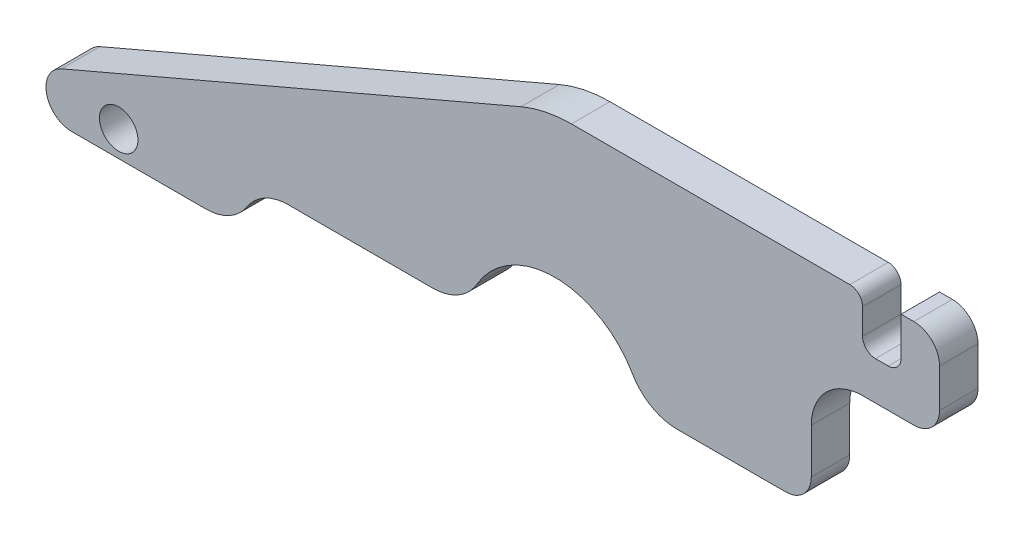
ISO-10303-21;
HEADER;
FILE_DESCRIPTION(('STEP AP214'),'2;1');
FILE_NAME('part.step','',(''),(''),'','','');
FILE_SCHEMA(('AUTOMOTIVE_DESIGN { 1 0 10303 214 1 1 1 1 }'));
ENDSEC;
DATA;
#1=APPLICATION_CONTEXT('core data for automotive mechanical design processes');
#2=APPLICATION_PROTOCOL_DEFINITION('international standard','automotive_design',2000,#1);
#3=PRODUCT_CONTEXT('',#1,'mechanical');
#4=PRODUCT('Part','Part','',(#3));
#5=PRODUCT_RELATED_PRODUCT_CATEGORY('part','',(#4));
#6=PRODUCT_DEFINITION_FORMATION('','',#4);
#7=PRODUCT_DEFINITION_CONTEXT('part definition',#1,'design');
#8=PRODUCT_DEFINITION('design','',#6,#7);
#9=PRODUCT_DEFINITION_SHAPE('','',#8);
#10=(LENGTH_UNIT() NAMED_UNIT(*) SI_UNIT(.MILLI.,.METRE.));
#11=(NAMED_UNIT(*) PLANE_ANGLE_UNIT() SI_UNIT($,.RADIAN.));
#12=(NAMED_UNIT(*) SI_UNIT($,.STERADIAN.) SOLID_ANGLE_UNIT());
#13=UNCERTAINTY_MEASURE_WITH_UNIT(LENGTH_MEASURE(1.E-05),#10,'distance_accuracy_value','');
#14=(GEOMETRIC_REPRESENTATION_CONTEXT(3) GLOBAL_UNCERTAINTY_ASSIGNED_CONTEXT((#13)) GLOBAL_UNIT_ASSIGNED_CONTEXT((#10,
#11,#12)) REPRESENTATION_CONTEXT('',''));
#15=CARTESIAN_POINT('',(0.,0.,0.));
#16=DIRECTION('',(0.,0.,1.));
#17=DIRECTION('',(1.,0.,0.));
#18=AXIS2_PLACEMENT_3D('',#15,#16,#17);
#19=CARTESIAN_POINT('',(5.99999999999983,12.5625,1.5));
#20=DIRECTION('',(0.,0.,-1.));
#21=DIRECTION('',(-1.,0.,0.));
#22=AXIS2_PLACEMENT_3D('',#19,#20,#21);
#23=PLANE('',#22);
#24=DIRECTION('',(-1.,0.,0.));
#25=VECTOR('',#24,1.);
#26=CARTESIAN_POINT('',(5.49999999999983,13.5625,1.5));
#27=LINE('',#26,#25);
#28=CARTESIAN_POINT('',(5.99999999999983,13.5625,1.5));
#29=VERTEX_POINT('',#28);
#30=CARTESIAN_POINT('',(5.49999999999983,13.5625,1.5));
#31=VERTEX_POINT('',#30);
#32=EDGE_CURVE('E290',#29,#31,#27,.T.);
#33=ORIENTED_EDGE('',*,*,#32,.T.);
#34=DIRECTION('',(0.,-1.,0.));
#35=VECTOR('',#34,1.);
#36=CARTESIAN_POINT('',(5.49999999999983,12.0625,1.5));
#37=LINE('',#36,#35);
#38=CARTESIAN_POINT('',(5.49999999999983,12.0625,1.5));
#39=VERTEX_POINT('',#38);
#40=EDGE_CURVE('E147',#31,#39,#37,.T.);
#41=ORIENTED_EDGE('',*,*,#40,.T.);
#42=CARTESIAN_POINT('',(4.99999999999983,12.0625,1.5));
#43=DIRECTION('',(0.,0.,-1.));
#44=DIRECTION('',(1.,0.,0.));
#45=AXIS2_PLACEMENT_3D('',#42,#43,#44);
#46=CIRCLE('',#45,0.5);
#47=CARTESIAN_POINT('',(4.99999999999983,11.5625,1.5));
#48=VERTEX_POINT('',#47);
#49=EDGE_CURVE('E359',#39,#48,#46,.T.);
#50=ORIENTED_EDGE('',*,*,#49,.T.);
#51=DIRECTION('',(-1.,0.,0.));
#52=VECTOR('',#51,1.);
#53=CARTESIAN_POINT('',(4.49999999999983,11.5625,1.5));
#54=LINE('',#53,#52);
#55=CARTESIAN_POINT('',(4.49999999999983,11.5625,1.5));
#56=VERTEX_POINT('',#55);
#57=EDGE_CURVE('E378',#48,#56,#54,.T.);
#58=ORIENTED_EDGE('',*,*,#57,.T.);
#59=CARTESIAN_POINT('',(4.49999999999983,12.0625,1.5));
#60=DIRECTION('',(0.,0.,-1.));
#61=DIRECTION('',(1.,0.,0.));
#62=AXIS2_PLACEMENT_3D('',#59,#60,#61);
#63=CIRCLE('',#62,0.500000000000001);
#64=CARTESIAN_POINT('',(3.99999999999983,12.0625,1.5));
#65=VERTEX_POINT('',#64);
#66=EDGE_CURVE('E375',#56,#65,#63,.T.);
#67=ORIENTED_EDGE('',*,*,#66,.T.);
#68=DIRECTION('',(0.,1.,0.));
#69=VECTOR('',#68,1.);
#70=CARTESIAN_POINT('',(3.99999999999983,13.0625,1.5));
#71=LINE('',#70,#69);
#72=CARTESIAN_POINT('',(3.99999999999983,13.0625,1.5));
#73=VERTEX_POINT('',#72);
#74=EDGE_CURVE('E377',#65,#73,#71,.T.);
#75=ORIENTED_EDGE('',*,*,#74,.T.);
#76=CARTESIAN_POINT('',(3.49999999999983,13.0625,1.5));
#77=DIRECTION('',(0.,0.,1.));
#78=DIRECTION('',(-1.,0.,0.));
#79=AXIS2_PLACEMENT_3D('',#76,#77,#78);
#80=CIRCLE('',#79,0.5);
#81=CARTESIAN_POINT('',(3.49999999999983,13.5625,1.5));
#82=VERTEX_POINT('',#81);
#83=EDGE_CURVE('E380',#73,#82,#80,.T.);
#84=ORIENTED_EDGE('',*,*,#83,.T.);
#85=DIRECTION('',(-1.,0.,0.));
#86=VECTOR('',#85,1.);
#87=CARTESIAN_POINT('',(-7.3486426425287,13.5625,1.5));
#88=LINE('',#87,#86);
#89=CARTESIAN_POINT('',(-7.3486426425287,13.5625,1.5));
#90=VERTEX_POINT('',#89);
#91=EDGE_CURVE('E386',#82,#90,#88,.T.);
#92=ORIENTED_EDGE('',*,*,#91,.T.);
#93=CARTESIAN_POINT('',(-7.3486426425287,8.56250000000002,1.5));
#94=DIRECTION('',(0.,0.,1.));
#95=DIRECTION('',(-1.,0.,0.));
#96=AXIS2_PLACEMENT_3D('',#93,#94,#95);
#97=CIRCLE('',#96,5.);
#98=CARTESIAN_POINT('',(-9.31836057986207,13.1581731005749,1.5));
#99=VERTEX_POINT('',#98);
#100=EDGE_CURVE('E388',#90,#99,#97,.T.);
#101=ORIENTED_EDGE('',*,*,#100,.T.);
#102=DIRECTION('',(-0.919134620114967,-0.393943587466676,0.));
#103=VECTOR('',#102,1.);
#104=CARTESIAN_POINT('',(-27.2289764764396,5.48163462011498,1.5));
#105=LINE('',#104,#103);
#106=CARTESIAN_POINT('',(-27.2289764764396,5.48163462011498,1.5));
#107=VERTEX_POINT('',#106);
#108=EDGE_CURVE('E390',#99,#107,#105,.T.);
#109=ORIENTED_EDGE('',*,*,#108,.T.);
#110=CARTESIAN_POINT('',(-26.8350328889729,4.56250000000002,1.5));
#111=DIRECTION('',(0.,0.,1.));
#112=DIRECTION('',(1.,0.,0.));
#113=AXIS2_PLACEMENT_3D('',#110,#111,#112);
#114=CIRCLE('',#113,0.999999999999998);
#115=CARTESIAN_POINT('',(-26.8350328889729,3.56250000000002,1.5));
#116=VERTEX_POINT('',#115);
#117=EDGE_CURVE('E392',#107,#116,#114,.T.);
#118=ORIENTED_EDGE('',*,*,#117,.T.);
#119=DIRECTION('',(1.,0.,0.));
#120=VECTOR('',#119,1.);
#121=CARTESIAN_POINT('',(-26.8350328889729,3.56250000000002,1.5));
#122=LINE('',#121,#120);
#123=CARTESIAN_POINT('',(-21.6038867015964,3.56250000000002,1.5));
#124=VERTEX_POINT('',#123);
#125=EDGE_CURVE('E394',#116,#124,#122,.T.);
#126=ORIENTED_EDGE('',*,*,#125,.T.);
#127=CARTESIAN_POINT('',(-21.6038867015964,5.46997288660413,1.5));
#128=DIRECTION('',(0.,0.,1.));
#129=DIRECTION('',(1.,0.,0.));
#130=AXIS2_PLACEMENT_3D('',#127,#128,#129);
#131=CIRCLE('',#130,1.90747288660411);
#132=CARTESIAN_POINT('',(-20.0000000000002,4.43750000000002,1.5));
#133=VERTEX_POINT('',#132);
#134=EDGE_CURVE('E396',#124,#133,#131,.T.);
#135=ORIENTED_EDGE('',*,*,#134,.T.);
#136=CARTESIAN_POINT('',(-18.396113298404,3.40502711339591,1.5));
#137=DIRECTION('',(0.,0.,-1.));
#138=DIRECTION('',(-1.,0.,0.));
#139=AXIS2_PLACEMENT_3D('',#136,#137,#138);
#140=CIRCLE('',#139,1.90747288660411);
#141=CARTESIAN_POINT('',(-18.396113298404,5.31250000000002,1.5));
#142=VERTEX_POINT('',#141);
#143=EDGE_CURVE('E398',#133,#142,#140,.T.);
#144=ORIENTED_EDGE('',*,*,#143,.T.);
#145=DIRECTION('',(1.,0.,0.));
#146=VECTOR('',#145,1.);
#147=CARTESIAN_POINT('',(-12.7631397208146,5.31250000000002,1.5));
#148=LINE('',#147,#146);
#149=CARTESIAN_POINT('',(-12.7631397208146,5.31250000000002,1.5));
#150=VERTEX_POINT('',#149);
#151=EDGE_CURVE('E400',#142,#150,#148,.T.);
#152=ORIENTED_EDGE('',*,*,#151,.T.);
#153=CARTESIAN_POINT('',(-12.7631397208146,7.31250000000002,1.5));
#154=DIRECTION('',(0.,0.,1.));
#155=DIRECTION('',(-1.,0.,0.));
#156=AXIS2_PLACEMENT_3D('',#153,#154,#155);
#157=CIRCLE('',#156,2.);
#158=CARTESIAN_POINT('',(-11.0310889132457,6.31250000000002,1.5));
#159=VERTEX_POINT('',#158);
#160=EDGE_CURVE('E402',#150,#159,#157,.T.);
#161=ORIENTED_EDGE('',*,*,#160,.T.);
#162=CARTESIAN_POINT('',(-8.00000000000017,4.56250000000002,1.5));
#163=DIRECTION('',(0.,0.,-1.));
#164=DIRECTION('',(-1.,0.,0.));
#165=AXIS2_PLACEMENT_3D('',#162,#163,#164);
#166=CIRCLE('',#165,3.5);
#167=CARTESIAN_POINT('',(-4.96891108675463,6.31250000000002,1.5));
#168=VERTEX_POINT('',#167);
#169=EDGE_CURVE('E404',#159,#168,#166,.T.);
#170=ORIENTED_EDGE('',*,*,#169,.T.);
#171=CARTESIAN_POINT('',(-3.23686027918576,7.31250000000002,1.5));
#172=DIRECTION('',(0.,0.,1.));
#173=DIRECTION('',(1.,0.,0.));
#174=AXIS2_PLACEMENT_3D('',#171,#172,#173);
#175=CIRCLE('',#174,2.);
#176=CARTESIAN_POINT('',(-3.23686027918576,5.31250000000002,1.5));
#177=VERTEX_POINT('',#176);
#178=EDGE_CURVE('E406',#168,#177,#175,.T.);
#179=ORIENTED_EDGE('',*,*,#178,.T.);
#180=DIRECTION('',(1.,0.,0.));
#181=VECTOR('',#180,1.);
#182=CARTESIAN_POINT('',(-3.23686027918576,5.31250000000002,1.5));
#183=LINE('',#182,#181);
#184=CARTESIAN_POINT('',(0.999999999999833,5.31250000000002,1.5));
#185=VERTEX_POINT('',#184);
#186=EDGE_CURVE('E408',#177,#185,#183,.T.);
#187=ORIENTED_EDGE('',*,*,#186,.T.);
#188=CARTESIAN_POINT('',(0.999999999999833,6.31250000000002,1.5));
#189=DIRECTION('',(0.,0.,1.));
#190=DIRECTION('',(-1.,0.,0.));
#191=AXIS2_PLACEMENT_3D('',#188,#189,#190);
#192=CIRCLE('',#191,1.);
#193=CARTESIAN_POINT('',(1.99999999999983,6.31250000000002,1.5));
#194=VERTEX_POINT('',#193);
#195=EDGE_CURVE('E410',#185,#194,#192,.T.);
#196=ORIENTED_EDGE('',*,*,#195,.T.);
#197=DIRECTION('',(0.,1.,0.));
#198=VECTOR('',#197,1.);
#199=CARTESIAN_POINT('',(1.99999999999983,8.06250000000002,1.5));
#200=LINE('',#199,#198);
#201=CARTESIAN_POINT('',(1.99999999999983,8.06250000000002,1.5));
#202=VERTEX_POINT('',#201);
#203=EDGE_CURVE('E412',#194,#202,#200,.T.);
#204=ORIENTED_EDGE('',*,*,#203,.T.);
#205=CARTESIAN_POINT('',(3.99999999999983,8.06250000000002,1.5));
#206=DIRECTION('',(0.,0.,-1.));
#207=DIRECTION('',(1.,0.,0.));
#208=AXIS2_PLACEMENT_3D('',#205,#206,#207);
#209=CIRCLE('',#208,2.);
#210=CARTESIAN_POINT('',(3.99999999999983,10.0625,1.5));
#211=VERTEX_POINT('',#210);
#212=EDGE_CURVE('E414',#202,#211,#209,.T.);
#213=ORIENTED_EDGE('',*,*,#212,.T.);
#214=DIRECTION('',(1.,0.,0.));
#215=VECTOR('',#214,1.);
#216=CARTESIAN_POINT('',(4.15524963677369,10.0625,1.5));
#217=LINE('',#216,#215);
#218=CARTESIAN_POINT('',(5.99999999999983,10.0625,1.5));
#219=VERTEX_POINT('',#218);
#220=EDGE_CURVE('E220',#211,#219,#217,.T.);
#221=ORIENTED_EDGE('',*,*,#220,.T.);
#222=CARTESIAN_POINT('',(5.99999999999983,11.0625,1.5));
#223=DIRECTION('',(0.,0.,1.));
#224=DIRECTION('',(-1.,0.,0.));
#225=AXIS2_PLACEMENT_3D('',#222,#223,#224);
#226=CIRCLE('',#225,1.);
#227=CARTESIAN_POINT('',(6.99999999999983,11.0625,1.5));
#228=VERTEX_POINT('',#227);
#229=EDGE_CURVE('E214',#219,#228,#226,.T.);
#230=ORIENTED_EDGE('',*,*,#229,.T.);
#231=DIRECTION('',(0.,1.,0.));
#232=VECTOR('',#231,1.);
#233=CARTESIAN_POINT('',(6.99999999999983,12.5625,1.5));
#234=LINE('',#233,#232);
#235=CARTESIAN_POINT('',(6.99999999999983,12.5625,1.5));
#236=VERTEX_POINT('',#235);
#237=EDGE_CURVE('E218',#228,#236,#234,.T.);
#238=ORIENTED_EDGE('',*,*,#237,.T.);
#239=CARTESIAN_POINT('',(5.99999999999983,12.5625,1.5));
#240=DIRECTION('',(0.,0.,1.));
#241=DIRECTION('',(-1.,0.,0.));
#242=AXIS2_PLACEMENT_3D('',#239,#240,#241);
#243=CIRCLE('',#242,1.);
#244=EDGE_CURVE('E50',#236,#29,#243,.T.);
#245=ORIENTED_EDGE('',*,*,#244,.T.);
#246=EDGE_LOOP('',(#33,#41,#50,#58,#67,#75,#84,#92,#101,#109,#118,#126,#135,#144,#152,#161,#170,
#179,#187,#196,#204,#213,#221,#230,#238,#245));
#247=FACE_BOUND('',#246,.T.);
#248=CARTESIAN_POINT('',(-25.0000000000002,4.56250000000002,1.5));
#249=DIRECTION('',(0.,0.,1.));
#250=DIRECTION('',(1.,0.,0.));
#251=AXIS2_PLACEMENT_3D('',#248,#249,#250);
#252=CIRCLE('',#251,0.750000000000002);
#253=CARTESIAN_POINT('',(-24.2500000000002,4.56250000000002,1.5));
#254=VERTEX_POINT('',#253);
#255=EDGE_CURVE('E242',#254,#254,#252,.T.);
#256=ORIENTED_EDGE('',*,*,#255,.F.);
#257=EDGE_LOOP('',(#256));
#258=FACE_BOUND('',#257,.T.);
#259=ADVANCED_FACE('F33',(#247,#258),#23,.F.);
#260=CARTESIAN_POINT('',(5.99999999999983,12.5625,0.));
#261=DIRECTION('',(0.,0.,-1.));
#262=DIRECTION('',(-1.,0.,0.));
#263=AXIS2_PLACEMENT_3D('',#260,#261,#262);
#264=PLANE('',#263);
#265=DIRECTION('',(-1.,0.,0.));
#266=VECTOR('',#265,1.);
#267=CARTESIAN_POINT('',(5.49999999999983,13.5625,0.));
#268=LINE('',#267,#266);
#269=CARTESIAN_POINT('',(5.99999999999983,13.5625,0.));
#270=VERTEX_POINT('',#269);
#271=CARTESIAN_POINT('',(5.49999999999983,13.5625,0.));
#272=VERTEX_POINT('',#271);
#273=EDGE_CURVE('E238',#270,#272,#268,.T.);
#274=ORIENTED_EDGE('',*,*,#273,.F.);
#275=CARTESIAN_POINT('',(5.99999999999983,12.5625,0.));
#276=DIRECTION('',(0.,0.,1.));
#277=DIRECTION('',(-1.,0.,0.));
#278=AXIS2_PLACEMENT_3D('',#275,#276,#277);
#279=CIRCLE('',#278,1.);
#280=CARTESIAN_POINT('',(6.99999999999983,12.5625,0.));
#281=VERTEX_POINT('',#280);
#282=EDGE_CURVE('E139',#281,#270,#279,.T.);
#283=ORIENTED_EDGE('',*,*,#282,.F.);
#284=DIRECTION('',(0.,1.,0.));
#285=VECTOR('',#284,1.);
#286=CARTESIAN_POINT('',(6.99999999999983,12.5625,0.));
#287=LINE('',#286,#285);
#288=CARTESIAN_POINT('',(6.99999999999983,11.0625,0.));
#289=VERTEX_POINT('',#288);
#290=EDGE_CURVE('E133',#289,#281,#287,.T.);
#291=ORIENTED_EDGE('',*,*,#290,.F.);
#292=CARTESIAN_POINT('',(5.99999999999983,11.0625,0.));
#293=DIRECTION('',(0.,0.,1.));
#294=DIRECTION('',(-1.,0.,0.));
#295=AXIS2_PLACEMENT_3D('',#292,#293,#294);
#296=CIRCLE('',#295,1.);
#297=CARTESIAN_POINT('',(5.99999999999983,10.0625,0.));
#298=VERTEX_POINT('',#297);
#299=EDGE_CURVE('E228',#298,#289,#296,.T.);
#300=ORIENTED_EDGE('',*,*,#299,.F.);
#301=DIRECTION('',(1.,0.,0.));
#302=VECTOR('',#301,1.);
#303=CARTESIAN_POINT('',(5.99999999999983,10.0625,0.));
#304=LINE('',#303,#302);
#305=CARTESIAN_POINT('',(3.99999999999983,10.0625,0.));
#306=VERTEX_POINT('',#305);
#307=EDGE_CURVE('E285',#306,#298,#304,.T.);
#308=ORIENTED_EDGE('',*,*,#307,.F.);
#309=CARTESIAN_POINT('',(3.99999999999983,8.06250000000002,0.));
#310=DIRECTION('',(0.,0.,-1.));
#311=DIRECTION('',(1.,0.,0.));
#312=AXIS2_PLACEMENT_3D('',#309,#310,#311);
#313=CIRCLE('',#312,2.);
#314=CARTESIAN_POINT('',(1.99999999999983,8.06250000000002,0.));
#315=VERTEX_POINT('',#314);
#316=EDGE_CURVE('E282',#315,#306,#313,.T.);
#317=ORIENTED_EDGE('',*,*,#316,.F.);
#318=DIRECTION('',(0.,1.,0.));
#319=VECTOR('',#318,1.);
#320=CARTESIAN_POINT('',(1.99999999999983,8.06250000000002,0.));
#321=LINE('',#320,#319);
#322=CARTESIAN_POINT('',(1.99999999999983,6.31250000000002,0.));
#323=VERTEX_POINT('',#322);
#324=EDGE_CURVE('E280',#323,#315,#321,.T.);
#325=ORIENTED_EDGE('',*,*,#324,.F.);
#326=CARTESIAN_POINT('',(0.999999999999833,6.31250000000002,0.));
#327=DIRECTION('',(0.,0.,1.));
#328=DIRECTION('',(-1.,0.,0.));
#329=AXIS2_PLACEMENT_3D('',#326,#327,#328);
#330=CIRCLE('',#329,1.);
#331=CARTESIAN_POINT('',(0.999999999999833,5.31250000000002,0.));
#332=VERTEX_POINT('',#331);
#333=EDGE_CURVE('E278',#332,#323,#330,.T.);
#334=ORIENTED_EDGE('',*,*,#333,.F.);
#335=DIRECTION('',(1.,0.,0.));
#336=VECTOR('',#335,1.);
#337=CARTESIAN_POINT('',(-3.23686027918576,5.31250000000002,0.));
#338=LINE('',#337,#336);
#339=CARTESIAN_POINT('',(-3.23686027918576,5.31250000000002,0.));
#340=VERTEX_POINT('',#339);
#341=EDGE_CURVE('E276',#340,#332,#338,.T.);
#342=ORIENTED_EDGE('',*,*,#341,.F.);
#343=CARTESIAN_POINT('',(-3.23686027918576,7.31250000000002,0.));
#344=DIRECTION('',(0.,0.,1.));
#345=DIRECTION('',(1.,0.,0.));
#346=AXIS2_PLACEMENT_3D('',#343,#344,#345);
#347=CIRCLE('',#346,2.);
#348=CARTESIAN_POINT('',(-4.96891108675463,6.31250000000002,0.));
#349=VERTEX_POINT('',#348);
#350=EDGE_CURVE('E274',#349,#340,#347,.T.);
#351=ORIENTED_EDGE('',*,*,#350,.F.);
#352=CARTESIAN_POINT('',(-8.00000000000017,4.56250000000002,0.));
#353=DIRECTION('',(0.,0.,-1.));
#354=DIRECTION('',(-1.,0.,0.));
#355=AXIS2_PLACEMENT_3D('',#352,#353,#354);
#356=CIRCLE('',#355,3.5);
#357=CARTESIAN_POINT('',(-11.0310889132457,6.31250000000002,0.));
#358=VERTEX_POINT('',#357);
#359=EDGE_CURVE('E272',#358,#349,#356,.T.);
#360=ORIENTED_EDGE('',*,*,#359,.F.);
#361=CARTESIAN_POINT('',(-12.7631397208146,7.31250000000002,0.));
#362=DIRECTION('',(0.,0.,1.));
#363=DIRECTION('',(-1.,0.,0.));
#364=AXIS2_PLACEMENT_3D('',#361,#362,#363);
#365=CIRCLE('',#364,2.);
#366=CARTESIAN_POINT('',(-12.7631397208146,5.31250000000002,0.));
#367=VERTEX_POINT('',#366);
#368=EDGE_CURVE('E270',#367,#358,#365,.T.);
#369=ORIENTED_EDGE('',*,*,#368,.F.);
#370=DIRECTION('',(1.,0.,0.));
#371=VECTOR('',#370,1.);
#372=CARTESIAN_POINT('',(-12.7631397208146,5.31250000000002,0.));
#373=LINE('',#372,#371);
#374=CARTESIAN_POINT('',(-18.396113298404,5.31250000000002,0.));
#375=VERTEX_POINT('',#374);
#376=EDGE_CURVE('E268',#375,#367,#373,.T.);
#377=ORIENTED_EDGE('',*,*,#376,.F.);
#378=CARTESIAN_POINT('',(-18.396113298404,3.40502711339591,0.));
#379=DIRECTION('',(0.,0.,-1.));
#380=DIRECTION('',(-1.,0.,0.));
#381=AXIS2_PLACEMENT_3D('',#378,#379,#380);
#382=CIRCLE('',#381,1.90747288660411);
#383=CARTESIAN_POINT('',(-20.0000000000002,4.43750000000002,0.));
#384=VERTEX_POINT('',#383);
#385=EDGE_CURVE('E266',#384,#375,#382,.T.);
#386=ORIENTED_EDGE('',*,*,#385,.F.);
#387=CARTESIAN_POINT('',(-21.6038867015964,5.46997288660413,0.));
#388=DIRECTION('',(0.,0.,1.));
#389=DIRECTION('',(1.,0.,0.));
#390=AXIS2_PLACEMENT_3D('',#387,#388,#389);
#391=CIRCLE('',#390,1.90747288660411);
#392=CARTESIAN_POINT('',(-21.6038867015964,3.56250000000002,0.));
#393=VERTEX_POINT('',#392);
#394=EDGE_CURVE('E264',#393,#384,#391,.T.);
#395=ORIENTED_EDGE('',*,*,#394,.F.);
#396=DIRECTION('',(1.,0.,0.));
#397=VECTOR('',#396,1.);
#398=CARTESIAN_POINT('',(-26.8350328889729,3.56250000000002,0.));
#399=LINE('',#398,#397);
#400=CARTESIAN_POINT('',(-26.8350328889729,3.56250000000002,0.));
#401=VERTEX_POINT('',#400);
#402=EDGE_CURVE('E262',#401,#393,#399,.T.);
#403=ORIENTED_EDGE('',*,*,#402,.F.);
#404=CARTESIAN_POINT('',(-26.8350328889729,4.56250000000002,0.));
#405=DIRECTION('',(0.,0.,1.));
#406=DIRECTION('',(1.,0.,0.));
#407=AXIS2_PLACEMENT_3D('',#404,#405,#406);
#408=CIRCLE('',#407,0.999999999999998);
#409=CARTESIAN_POINT('',(-27.2289764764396,5.48163462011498,0.));
#410=VERTEX_POINT('',#409);
#411=EDGE_CURVE('E260',#410,#401,#408,.T.);
#412=ORIENTED_EDGE('',*,*,#411,.F.);
#413=DIRECTION('',(-0.919134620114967,-0.393943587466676,0.));
#414=VECTOR('',#413,1.);
#415=CARTESIAN_POINT('',(-27.2289764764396,5.48163462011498,0.));
#416=LINE('',#415,#414);
#417=CARTESIAN_POINT('',(-9.31836057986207,13.1581731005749,0.));
#418=VERTEX_POINT('',#417);
#419=EDGE_CURVE('E258',#418,#410,#416,.T.);
#420=ORIENTED_EDGE('',*,*,#419,.F.);
#421=CARTESIAN_POINT('',(-7.3486426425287,8.56250000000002,0.));
#422=DIRECTION('',(0.,0.,1.));
#423=DIRECTION('',(-1.,0.,0.));
#424=AXIS2_PLACEMENT_3D('',#421,#422,#423);
#425=CIRCLE('',#424,5.);
#426=CARTESIAN_POINT('',(-7.3486426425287,13.5625,0.));
#427=VERTEX_POINT('',#426);
#428=EDGE_CURVE('E256',#427,#418,#425,.T.);
#429=ORIENTED_EDGE('',*,*,#428,.F.);
#430=DIRECTION('',(-1.,0.,0.));
#431=VECTOR('',#430,1.);
#432=CARTESIAN_POINT('',(-7.3486426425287,13.5625,0.));
#433=LINE('',#432,#431);
#434=CARTESIAN_POINT('',(3.49999999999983,13.5625,0.));
#435=VERTEX_POINT('',#434);
#436=EDGE_CURVE('E254',#435,#427,#433,.T.);
#437=ORIENTED_EDGE('',*,*,#436,.F.);
#438=CARTESIAN_POINT('',(3.49999999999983,13.0625,0.));
#439=DIRECTION('',(0.,0.,1.));
#440=DIRECTION('',(-1.,0.,0.));
#441=AXIS2_PLACEMENT_3D('',#438,#439,#440);
#442=CIRCLE('',#441,0.5);
#443=CARTESIAN_POINT('',(3.99999999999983,13.0625,0.));
#444=VERTEX_POINT('',#443);
#445=EDGE_CURVE('E252',#444,#435,#442,.T.);
#446=ORIENTED_EDGE('',*,*,#445,.F.);
#447=DIRECTION('',(0.,1.,0.));
#448=VECTOR('',#447,1.);
#449=CARTESIAN_POINT('',(3.99999999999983,13.0625,0.));
#450=LINE('',#449,#448);
#451=CARTESIAN_POINT('',(3.99999999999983,12.0625,0.));
#452=VERTEX_POINT('',#451);
#453=EDGE_CURVE('E250',#452,#444,#450,.T.);
#454=ORIENTED_EDGE('',*,*,#453,.F.);
#455=CARTESIAN_POINT('',(4.49999999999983,12.0625,0.));
#456=DIRECTION('',(0.,0.,-1.));
#457=DIRECTION('',(1.,0.,0.));
#458=AXIS2_PLACEMENT_3D('',#455,#456,#457);
#459=CIRCLE('',#458,0.500000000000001);
#460=CARTESIAN_POINT('',(4.49999999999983,11.5625,0.));
#461=VERTEX_POINT('',#460);
#462=EDGE_CURVE('E248',#461,#452,#459,.T.);
#463=ORIENTED_EDGE('',*,*,#462,.F.);
#464=DIRECTION('',(-1.,0.,0.));
#465=VECTOR('',#464,1.);
#466=CARTESIAN_POINT('',(4.49999999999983,11.5625,0.));
#467=LINE('',#466,#465);
#468=CARTESIAN_POINT('',(4.99999999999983,11.5625,0.));
#469=VERTEX_POINT('',#468);
#470=EDGE_CURVE('E246',#469,#461,#467,.T.);
#471=ORIENTED_EDGE('',*,*,#470,.F.);
#472=CARTESIAN_POINT('',(4.99999999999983,12.0625,0.));
#473=DIRECTION('',(0.,0.,-1.));
#474=DIRECTION('',(1.,0.,0.));
#475=AXIS2_PLACEMENT_3D('',#472,#473,#474);
#476=CIRCLE('',#475,0.5);
#477=CARTESIAN_POINT('',(5.49999999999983,12.0625,0.));
#478=VERTEX_POINT('',#477);
#479=EDGE_CURVE('E244',#478,#469,#476,.T.);
#480=ORIENTED_EDGE('',*,*,#479,.F.);
#481=DIRECTION('',(0.,-1.,0.));
#482=VECTOR('',#481,1.);
#483=CARTESIAN_POINT('',(5.49999999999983,12.0625,0.));
#484=LINE('',#483,#482);
#485=EDGE_CURVE('E241',#272,#478,#484,.T.);
#486=ORIENTED_EDGE('',*,*,#485,.F.);
#487=EDGE_LOOP('',(#274,#283,#291,#300,#308,#317,#325,#334,#342,#351,#360,#369,#377,#386,#395,
#403,#412,#420,#429,#437,#446,#454,#463,#471,#480,#486));
#488=FACE_BOUND('',#487,.T.);
#489=CARTESIAN_POINT('',(-25.0000000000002,4.56250000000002,0.));
#490=DIRECTION('',(0.,0.,1.));
#491=DIRECTION('',(1.,0.,0.));
#492=AXIS2_PLACEMENT_3D('',#489,#490,#491);
#493=CIRCLE('',#492,0.750000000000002);
#494=CARTESIAN_POINT('',(-24.2500000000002,4.56250000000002,0.));
#495=VERTEX_POINT('',#494);
#496=EDGE_CURVE('E745',#495,#495,#493,.T.);
#497=ORIENTED_EDGE('',*,*,#496,.T.);
#498=EDGE_LOOP('',(#497));
#499=FACE_BOUND('',#498,.T.);
#500=ADVANCED_FACE('F363',(#488,#499),#264,.T.);
#501=CARTESIAN_POINT('',(5.49999999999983,13.5625,1.5));
#502=DIRECTION('',(0.,-1.,0.));
#503=DIRECTION('',(0.,0.,-1.));
#504=AXIS2_PLACEMENT_3D('',#501,#502,#503);
#505=PLANE('',#504);
#506=ORIENTED_EDGE('',*,*,#273,.T.);
#507=DIRECTION('',(0.,0.,-1.));
#508=VECTOR('',#507,1.);
#509=CARTESIAN_POINT('',(5.49999999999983,13.5625,1.5));
#510=LINE('',#509,#508);
#511=EDGE_CURVE('E11',#31,#272,#510,.T.);
#512=ORIENTED_EDGE('',*,*,#511,.F.);
#513=ORIENTED_EDGE('',*,*,#32,.F.);
#514=DIRECTION('',(0.,0.,-1.));
#515=VECTOR('',#514,1.);
#516=CARTESIAN_POINT('',(5.99999999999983,13.5625,1.5));
#517=LINE('',#516,#515);
#518=EDGE_CURVE('E234',#29,#270,#517,.T.);
#519=ORIENTED_EDGE('',*,*,#518,.T.);
#520=EDGE_LOOP('',(#506,#512,#513,#519));
#521=FACE_BOUND('',#520,.T.);
#522=ADVANCED_FACE('F35',(#521),#505,.F.);
#523=CARTESIAN_POINT('',(5.49999999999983,12.0625,1.5));
#524=DIRECTION('',(1.,0.,0.));
#525=DIRECTION('',(0.,0.,-1.));
#526=AXIS2_PLACEMENT_3D('',#523,#524,#525);
#527=PLANE('',#526);
#528=ORIENTED_EDGE('',*,*,#485,.T.);
#529=DIRECTION('',(0.,0.,-1.));
#530=VECTOR('',#529,1.);
#531=CARTESIAN_POINT('',(5.49999999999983,12.0625,1.5));
#532=LINE('',#531,#530);
#533=EDGE_CURVE('E42',#39,#478,#532,.T.);
#534=ORIENTED_EDGE('',*,*,#533,.F.);
#535=ORIENTED_EDGE('',*,*,#40,.F.);
#536=ORIENTED_EDGE('',*,*,#511,.T.);
#537=EDGE_LOOP('',(#528,#534,#535,#536));
#538=FACE_BOUND('',#537,.T.);
#539=ADVANCED_FACE('F447',(#538),#527,.F.);
#540=CARTESIAN_POINT('',(4.99999999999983,12.0625,1.5));
#541=DIRECTION('',(0.,0.,-1.));
#542=DIRECTION('',(-1.,0.,0.));
#543=AXIS2_PLACEMENT_3D('',#540,#541,#542);
#544=CYLINDRICAL_SURFACE('',#543,0.5);
#545=ORIENTED_EDGE('',*,*,#479,.T.);
#546=DIRECTION('',(0.,0.,-1.));
#547=VECTOR('',#546,1.);
#548=CARTESIAN_POINT('',(4.99999999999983,11.5625,1.5));
#549=LINE('',#548,#547);
#550=EDGE_CURVE('E351',#48,#469,#549,.T.);
#551=ORIENTED_EDGE('',*,*,#550,.F.);
#552=ORIENTED_EDGE('',*,*,#49,.F.);
#553=ORIENTED_EDGE('',*,*,#533,.T.);
#554=EDGE_LOOP('',(#545,#551,#552,#553));
#555=FACE_BOUND('',#554,.T.);
#556=ADVANCED_FACE('F357',(#555),#544,.F.);
#557=CARTESIAN_POINT('',(4.49999999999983,11.5625,1.5));
#558=DIRECTION('',(0.,-1.,0.));
#559=DIRECTION('',(0.,0.,-1.));
#560=AXIS2_PLACEMENT_3D('',#557,#558,#559);
#561=PLANE('',#560);
#562=ORIENTED_EDGE('',*,*,#470,.T.);
#563=DIRECTION('',(0.,0.,-1.));
#564=VECTOR('',#563,1.);
#565=CARTESIAN_POINT('',(4.49999999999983,11.5625,1.5));
#566=LINE('',#565,#564);
#567=EDGE_CURVE('E348',#56,#461,#566,.T.);
#568=ORIENTED_EDGE('',*,*,#567,.F.);
#569=ORIENTED_EDGE('',*,*,#57,.F.);
#570=ORIENTED_EDGE('',*,*,#550,.T.);
#571=EDGE_LOOP('',(#562,#568,#569,#570));
#572=FACE_BOUND('',#571,.T.);
#573=ADVANCED_FACE('F369',(#572),#561,.F.);
#574=CARTESIAN_POINT('',(4.49999999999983,12.0625,1.5));
#575=DIRECTION('',(0.,0.,-1.));
#576=DIRECTION('',(-1.,0.,0.));
#577=AXIS2_PLACEMENT_3D('',#574,#575,#576);
#578=CYLINDRICAL_SURFACE('',#577,0.500000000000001);
#579=ORIENTED_EDGE('',*,*,#462,.T.);
#580=DIRECTION('',(0.,0.,-1.));
#581=VECTOR('',#580,1.);
#582=CARTESIAN_POINT('',(3.99999999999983,12.0625,1.5));
#583=LINE('',#582,#581);
#584=EDGE_CURVE('E345',#65,#452,#583,.T.);
#585=ORIENTED_EDGE('',*,*,#584,.F.);
#586=ORIENTED_EDGE('',*,*,#66,.F.);
#587=ORIENTED_EDGE('',*,*,#567,.T.);
#588=EDGE_LOOP('',(#579,#585,#586,#587));
#589=FACE_BOUND('',#588,.T.);
#590=ADVANCED_FACE('F373',(#589),#578,.F.);
#591=CARTESIAN_POINT('',(3.99999999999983,13.0625,1.5));
#592=DIRECTION('',(-1.,0.,0.));
#593=DIRECTION('',(0.,-1.,0.));
#594=AXIS2_PLACEMENT_3D('',#591,#592,#593);
#595=PLANE('',#594);
#596=ORIENTED_EDGE('',*,*,#453,.T.);
#597=DIRECTION('',(0.,0.,-1.));
#598=VECTOR('',#597,1.);
#599=CARTESIAN_POINT('',(3.99999999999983,13.0625,1.5));
#600=LINE('',#599,#598);
#601=EDGE_CURVE('E342',#73,#444,#600,.T.);
#602=ORIENTED_EDGE('',*,*,#601,.F.);
#603=ORIENTED_EDGE('',*,*,#74,.F.);
#604=ORIENTED_EDGE('',*,*,#584,.T.);
#605=EDGE_LOOP('',(#596,#602,#603,#604));
#606=FACE_BOUND('',#605,.T.);
#607=ADVANCED_FACE('F460',(#606),#595,.F.);
#608=CARTESIAN_POINT('',(3.49999999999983,13.0625,1.5));
#609=DIRECTION('',(0.,0.,-1.));
#610=DIRECTION('',(-1.,0.,0.));
#611=AXIS2_PLACEMENT_3D('',#608,#609,#610);
#612=CYLINDRICAL_SURFACE('',#611,0.5);
#613=ORIENTED_EDGE('',*,*,#445,.T.);
#614=DIRECTION('',(0.,0.,-1.));
#615=VECTOR('',#614,1.);
#616=CARTESIAN_POINT('',(3.49999999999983,13.5625,1.5));
#617=LINE('',#616,#615);
#618=EDGE_CURVE('E339',#82,#435,#617,.T.);
#619=ORIENTED_EDGE('',*,*,#618,.F.);
#620=ORIENTED_EDGE('',*,*,#83,.F.);
#621=ORIENTED_EDGE('',*,*,#601,.T.);
#622=EDGE_LOOP('',(#613,#619,#620,#621));
#623=FACE_BOUND('',#622,.T.);
#624=ADVANCED_FACE('F463',(#623),#612,.T.);
#625=CARTESIAN_POINT('',(-7.3486426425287,13.5625,1.5));
#626=DIRECTION('',(0.,-1.,0.));
#627=DIRECTION('',(0.,0.,-1.));
#628=AXIS2_PLACEMENT_3D('',#625,#626,#627);
#629=PLANE('',#628);
#630=ORIENTED_EDGE('',*,*,#436,.T.);
#631=DIRECTION('',(0.,0.,-1.));
#632=VECTOR('',#631,1.);
#633=CARTESIAN_POINT('',(-7.3486426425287,13.5625,1.5));
#634=LINE('',#633,#632);
#635=EDGE_CURVE('E336',#90,#427,#634,.T.);
#636=ORIENTED_EDGE('',*,*,#635,.F.);
#637=ORIENTED_EDGE('',*,*,#91,.F.);
#638=ORIENTED_EDGE('',*,*,#618,.T.);
#639=EDGE_LOOP('',(#630,#636,#637,#638));
#640=FACE_BOUND('',#639,.T.);
#641=ADVANCED_FACE('F467',(#640),#629,.F.);
#642=CARTESIAN_POINT('',(-7.3486426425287,8.56250000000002,1.5));
#643=DIRECTION('',(0.,0.,-1.));
#644=DIRECTION('',(-1.,0.,0.));
#645=AXIS2_PLACEMENT_3D('',#642,#643,#644);
#646=CYLINDRICAL_SURFACE('',#645,5.);
#647=ORIENTED_EDGE('',*,*,#428,.T.);
#648=DIRECTION('',(0.,0.,-1.));
#649=VECTOR('',#648,1.);
#650=CARTESIAN_POINT('',(-9.31836057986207,13.1581731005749,1.5));
#651=LINE('',#650,#649);
#652=EDGE_CURVE('E333',#99,#418,#651,.T.);
#653=ORIENTED_EDGE('',*,*,#652,.F.);
#654=ORIENTED_EDGE('',*,*,#100,.F.);
#655=ORIENTED_EDGE('',*,*,#635,.T.);
#656=EDGE_LOOP('',(#647,#653,#654,#655));
#657=FACE_BOUND('',#656,.T.);
#658=ADVANCED_FACE('F471',(#657),#646,.T.);
#659=CARTESIAN_POINT('',(-27.2289764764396,5.48163462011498,1.5));
#660=DIRECTION('',(0.393943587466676,-0.919134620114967,0.));
#661=DIRECTION('',(0.919134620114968,0.393943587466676,0.));
#662=AXIS2_PLACEMENT_3D('',#659,#660,#661);
#663=PLANE('',#662);
#664=ORIENTED_EDGE('',*,*,#419,.T.);
#665=DIRECTION('',(0.,0.,-1.));
#666=VECTOR('',#665,1.);
#667=CARTESIAN_POINT('',(-27.2289764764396,5.48163462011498,1.5));
#668=LINE('',#667,#666);
#669=EDGE_CURVE('E330',#107,#410,#668,.T.);
#670=ORIENTED_EDGE('',*,*,#669,.F.);
#671=ORIENTED_EDGE('',*,*,#108,.F.);
#672=ORIENTED_EDGE('',*,*,#652,.T.);
#673=EDGE_LOOP('',(#664,#670,#671,#672));
#674=FACE_BOUND('',#673,.T.);
#675=ADVANCED_FACE('F475',(#674),#663,.F.);
#676=CARTESIAN_POINT('',(-26.8350328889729,4.56250000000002,1.5));
#677=DIRECTION('',(0.,0.,-1.));
#678=DIRECTION('',(-1.,0.,0.));
#679=AXIS2_PLACEMENT_3D('',#676,#677,#678);
#680=CYLINDRICAL_SURFACE('',#679,0.999999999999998);
#681=ORIENTED_EDGE('',*,*,#411,.T.);
#682=DIRECTION('',(0.,0.,-1.));
#683=VECTOR('',#682,1.);
#684=CARTESIAN_POINT('',(-26.8350328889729,3.56250000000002,1.5));
#685=LINE('',#684,#683);
#686=EDGE_CURVE('E327',#116,#401,#685,.T.);
#687=ORIENTED_EDGE('',*,*,#686,.F.);
#688=ORIENTED_EDGE('',*,*,#117,.F.);
#689=ORIENTED_EDGE('',*,*,#669,.T.);
#690=EDGE_LOOP('',(#681,#687,#688,#689));
#691=FACE_BOUND('',#690,.T.);
#692=ADVANCED_FACE('F479',(#691),#680,.T.);
#693=CARTESIAN_POINT('',(-26.8350328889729,3.56250000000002,1.5));
#694=DIRECTION('',(0.,1.,0.));
#695=DIRECTION('',(0.,0.,1.));
#696=AXIS2_PLACEMENT_3D('',#693,#694,#695);
#697=PLANE('',#696);
#698=ORIENTED_EDGE('',*,*,#402,.T.);
#699=DIRECTION('',(0.,0.,-1.));
#700=VECTOR('',#699,1.);
#701=CARTESIAN_POINT('',(-21.6038867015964,3.56250000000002,1.5));
#702=LINE('',#701,#700);
#703=EDGE_CURVE('E324',#124,#393,#702,.T.);
#704=ORIENTED_EDGE('',*,*,#703,.F.);
#705=ORIENTED_EDGE('',*,*,#125,.F.);
#706=ORIENTED_EDGE('',*,*,#686,.T.);
#707=EDGE_LOOP('',(#698,#704,#705,#706));
#708=FACE_BOUND('',#707,.T.);
#709=ADVANCED_FACE('F483',(#708),#697,.F.);
#710=CARTESIAN_POINT('',(-21.6038867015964,5.46997288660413,1.5));
#711=DIRECTION('',(0.,0.,-1.));
#712=DIRECTION('',(-1.,0.,0.));
#713=AXIS2_PLACEMENT_3D('',#710,#711,#712);
#714=CYLINDRICAL_SURFACE('',#713,1.90747288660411);
#715=ORIENTED_EDGE('',*,*,#394,.T.);
#716=DIRECTION('',(0.,0.,-1.));
#717=VECTOR('',#716,1.);
#718=CARTESIAN_POINT('',(-20.0000000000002,4.43750000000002,1.5));
#719=LINE('',#718,#717);
#720=EDGE_CURVE('E321',#133,#384,#719,.T.);
#721=ORIENTED_EDGE('',*,*,#720,.F.);
#722=ORIENTED_EDGE('',*,*,#134,.F.);
#723=ORIENTED_EDGE('',*,*,#703,.T.);
#724=EDGE_LOOP('',(#715,#721,#722,#723));
#725=FACE_BOUND('',#724,.T.);
#726=ADVANCED_FACE('F487',(#725),#714,.T.);
#727=CARTESIAN_POINT('',(-18.396113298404,3.40502711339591,1.5));
#728=DIRECTION('',(0.,0.,-1.));
#729=DIRECTION('',(-1.,0.,0.));
#730=AXIS2_PLACEMENT_3D('',#727,#728,#729);
#731=CYLINDRICAL_SURFACE('',#730,1.90747288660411);
#732=ORIENTED_EDGE('',*,*,#385,.T.);
#733=DIRECTION('',(0.,0.,-1.));
#734=VECTOR('',#733,1.);
#735=CARTESIAN_POINT('',(-18.396113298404,5.31250000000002,1.5));
#736=LINE('',#735,#734);
#737=EDGE_CURVE('E318',#142,#375,#736,.T.);
#738=ORIENTED_EDGE('',*,*,#737,.F.);
#739=ORIENTED_EDGE('',*,*,#143,.F.);
#740=ORIENTED_EDGE('',*,*,#720,.T.);
#741=EDGE_LOOP('',(#732,#738,#739,#740));
#742=FACE_BOUND('',#741,.T.);
#743=ADVANCED_FACE('F491',(#742),#731,.F.);
#744=CARTESIAN_POINT('',(-12.7631397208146,5.31250000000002,1.5));
#745=DIRECTION('',(0.,1.,0.));
#746=DIRECTION('',(-1.,0.,0.));
#747=AXIS2_PLACEMENT_3D('',#744,#745,#746);
#748=PLANE('',#747);
#749=ORIENTED_EDGE('',*,*,#376,.T.);
#750=DIRECTION('',(0.,0.,-1.));
#751=VECTOR('',#750,1.);
#752=CARTESIAN_POINT('',(-12.7631397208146,5.31250000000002,1.5));
#753=LINE('',#752,#751);
#754=EDGE_CURVE('E315',#150,#367,#753,.T.);
#755=ORIENTED_EDGE('',*,*,#754,.F.);
#756=ORIENTED_EDGE('',*,*,#151,.F.);
#757=ORIENTED_EDGE('',*,*,#737,.T.);
#758=EDGE_LOOP('',(#749,#755,#756,#757));
#759=FACE_BOUND('',#758,.T.);
#760=ADVANCED_FACE('F495',(#759),#748,.F.);
#761=CARTESIAN_POINT('',(-12.7631397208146,7.31250000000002,1.5));
#762=DIRECTION('',(0.,0.,-1.));
#763=DIRECTION('',(-1.,0.,0.));
#764=AXIS2_PLACEMENT_3D('',#761,#762,#763);
#765=CYLINDRICAL_SURFACE('',#764,2.);
#766=ORIENTED_EDGE('',*,*,#368,.T.);
#767=DIRECTION('',(0.,0.,-1.));
#768=VECTOR('',#767,1.);
#769=CARTESIAN_POINT('',(-11.0310889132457,6.31250000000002,1.5));
#770=LINE('',#769,#768);
#771=EDGE_CURVE('E312',#159,#358,#770,.T.);
#772=ORIENTED_EDGE('',*,*,#771,.F.);
#773=ORIENTED_EDGE('',*,*,#160,.F.);
#774=ORIENTED_EDGE('',*,*,#754,.T.);
#775=EDGE_LOOP('',(#766,#772,#773,#774));
#776=FACE_BOUND('',#775,.T.);
#777=ADVANCED_FACE('F499',(#776),#765,.T.);
#778=CARTESIAN_POINT('',(-8.00000000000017,4.56250000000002,1.5));
#779=DIRECTION('',(0.,0.,-1.));
#780=DIRECTION('',(-1.,0.,0.));
#781=AXIS2_PLACEMENT_3D('',#778,#779,#780);
#782=CYLINDRICAL_SURFACE('',#781,3.5);
#783=ORIENTED_EDGE('',*,*,#359,.T.);
#784=DIRECTION('',(0.,0.,-1.));
#785=VECTOR('',#784,1.);
#786=CARTESIAN_POINT('',(-4.96891108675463,6.31250000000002,1.5));
#787=LINE('',#786,#785);
#788=EDGE_CURVE('E309',#168,#349,#787,.T.);
#789=ORIENTED_EDGE('',*,*,#788,.F.);
#790=ORIENTED_EDGE('',*,*,#169,.F.);
#791=ORIENTED_EDGE('',*,*,#771,.T.);
#792=EDGE_LOOP('',(#783,#789,#790,#791));
#793=FACE_BOUND('',#792,.T.);
#794=ADVANCED_FACE('F503',(#793),#782,.F.);
#795=CARTESIAN_POINT('',(-3.23686027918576,7.31250000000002,1.5));
#796=DIRECTION('',(0.,0.,-1.));
#797=DIRECTION('',(-1.,0.,0.));
#798=AXIS2_PLACEMENT_3D('',#795,#796,#797);
#799=CYLINDRICAL_SURFACE('',#798,2.);
#800=ORIENTED_EDGE('',*,*,#350,.T.);
#801=DIRECTION('',(0.,0.,-1.));
#802=VECTOR('',#801,1.);
#803=CARTESIAN_POINT('',(-3.23686027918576,5.31250000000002,1.5));
#804=LINE('',#803,#802);
#805=EDGE_CURVE('E306',#177,#340,#804,.T.);
#806=ORIENTED_EDGE('',*,*,#805,.F.);
#807=ORIENTED_EDGE('',*,*,#178,.F.);
#808=ORIENTED_EDGE('',*,*,#788,.T.);
#809=EDGE_LOOP('',(#800,#806,#807,#808));
#810=FACE_BOUND('',#809,.T.);
#811=ADVANCED_FACE('F507',(#810),#799,.T.);
#812=CARTESIAN_POINT('',(-3.23686027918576,5.31250000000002,1.5));
#813=DIRECTION('',(0.,1.,0.));
#814=DIRECTION('',(-1.,0.,0.));
#815=AXIS2_PLACEMENT_3D('',#812,#813,#814);
#816=PLANE('',#815);
#817=ORIENTED_EDGE('',*,*,#341,.T.);
#818=DIRECTION('',(0.,0.,-1.));
#819=VECTOR('',#818,1.);
#820=CARTESIAN_POINT('',(0.999999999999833,5.31250000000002,1.5));
#821=LINE('',#820,#819);
#822=EDGE_CURVE('E303',#185,#332,#821,.T.);
#823=ORIENTED_EDGE('',*,*,#822,.F.);
#824=ORIENTED_EDGE('',*,*,#186,.F.);
#825=ORIENTED_EDGE('',*,*,#805,.T.);
#826=EDGE_LOOP('',(#817,#823,#824,#825));
#827=FACE_BOUND('',#826,.T.);
#828=ADVANCED_FACE('F511',(#827),#816,.F.);
#829=CARTESIAN_POINT('',(0.999999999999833,6.31250000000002,1.5));
#830=DIRECTION('',(0.,0.,-1.));
#831=DIRECTION('',(-1.,0.,0.));
#832=AXIS2_PLACEMENT_3D('',#829,#830,#831);
#833=CYLINDRICAL_SURFACE('',#832,1.);
#834=ORIENTED_EDGE('',*,*,#333,.T.);
#835=DIRECTION('',(0.,0.,-1.));
#836=VECTOR('',#835,1.);
#837=CARTESIAN_POINT('',(1.99999999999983,6.31250000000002,1.5));
#838=LINE('',#837,#836);
#839=EDGE_CURVE('E300',#194,#323,#838,.T.);
#840=ORIENTED_EDGE('',*,*,#839,.F.);
#841=ORIENTED_EDGE('',*,*,#195,.F.);
#842=ORIENTED_EDGE('',*,*,#822,.T.);
#843=EDGE_LOOP('',(#834,#840,#841,#842));
#844=FACE_BOUND('',#843,.T.);
#845=ADVANCED_FACE('F515',(#844),#833,.T.);
#846=CARTESIAN_POINT('',(1.99999999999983,8.06250000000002,1.5));
#847=DIRECTION('',(-1.,0.,0.));
#848=DIRECTION('',(0.,-1.,0.));
#849=AXIS2_PLACEMENT_3D('',#846,#847,#848);
#850=PLANE('',#849);
#851=ORIENTED_EDGE('',*,*,#324,.T.);
#852=DIRECTION('',(0.,0.,-1.));
#853=VECTOR('',#852,1.);
#854=CARTESIAN_POINT('',(1.99999999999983,8.06250000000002,1.5));
#855=LINE('',#854,#853);
#856=EDGE_CURVE('E297',#202,#315,#855,.T.);
#857=ORIENTED_EDGE('',*,*,#856,.F.);
#858=ORIENTED_EDGE('',*,*,#203,.F.);
#859=ORIENTED_EDGE('',*,*,#839,.T.);
#860=EDGE_LOOP('',(#851,#857,#858,#859));
#861=FACE_BOUND('',#860,.T.);
#862=ADVANCED_FACE('F519',(#861),#850,.F.);
#863=CARTESIAN_POINT('',(3.99999999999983,8.06250000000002,1.5));
#864=DIRECTION('',(0.,0.,-1.));
#865=DIRECTION('',(-1.,0.,0.));
#866=AXIS2_PLACEMENT_3D('',#863,#864,#865);
#867=CYLINDRICAL_SURFACE('',#866,2.);
#868=ORIENTED_EDGE('',*,*,#316,.T.);
#869=DIRECTION('',(0.,0.,-1.));
#870=VECTOR('',#869,1.);
#871=CARTESIAN_POINT('',(3.99999999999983,10.0625,1.5));
#872=LINE('',#871,#870);
#873=EDGE_CURVE('E294',#211,#306,#872,.T.);
#874=ORIENTED_EDGE('',*,*,#873,.F.);
#875=ORIENTED_EDGE('',*,*,#212,.F.);
#876=ORIENTED_EDGE('',*,*,#856,.T.);
#877=EDGE_LOOP('',(#868,#874,#875,#876));
#878=FACE_BOUND('',#877,.T.);
#879=ADVANCED_FACE('F420',(#878),#867,.F.);
#880=CARTESIAN_POINT('',(5.99999999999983,10.0625,1.5));
#881=DIRECTION('',(0.,1.,0.));
#882=DIRECTION('',(0.,0.,1.));
#883=AXIS2_PLACEMENT_3D('',#880,#881,#882);
#884=PLANE('',#883);
#885=ORIENTED_EDGE('',*,*,#307,.T.);
#886=DIRECTION('',(0.,0.,-1.));
#887=VECTOR('',#886,1.);
#888=CARTESIAN_POINT('',(5.99999999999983,10.0625,1.5));
#889=LINE('',#888,#887);
#890=EDGE_CURVE('E229',#219,#298,#889,.T.);
#891=ORIENTED_EDGE('',*,*,#890,.F.);
#892=ORIENTED_EDGE('',*,*,#220,.F.);
#893=ORIENTED_EDGE('',*,*,#873,.T.);
#894=EDGE_LOOP('',(#885,#891,#892,#893));
#895=FACE_BOUND('',#894,.T.);
#896=ADVANCED_FACE('F423',(#895),#884,.F.);
#897=CARTESIAN_POINT('',(5.99999999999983,11.0625,1.5));
#898=DIRECTION('',(0.,0.,-1.));
#899=DIRECTION('',(-1.,0.,0.));
#900=AXIS2_PLACEMENT_3D('',#897,#898,#899);
#901=CYLINDRICAL_SURFACE('',#900,1.);
#902=ORIENTED_EDGE('',*,*,#299,.T.);
#903=DIRECTION('',(0.,0.,-1.));
#904=VECTOR('',#903,1.);
#905=CARTESIAN_POINT('',(6.99999999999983,11.0625,1.5));
#906=LINE('',#905,#904);
#907=EDGE_CURVE('E225',#228,#289,#906,.T.);
#908=ORIENTED_EDGE('',*,*,#907,.F.);
#909=ORIENTED_EDGE('',*,*,#229,.F.);
#910=ORIENTED_EDGE('',*,*,#890,.T.);
#911=EDGE_LOOP('',(#902,#908,#909,#910));
#912=FACE_BOUND('',#911,.T.);
#913=ADVANCED_FACE('F226',(#912),#901,.T.);
#914=CARTESIAN_POINT('',(6.99999999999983,12.5625,1.5));
#915=DIRECTION('',(-1.,0.,0.));
#916=DIRECTION('',(0.,0.,1.));
#917=AXIS2_PLACEMENT_3D('',#914,#915,#916);
#918=PLANE('',#917);
#919=ORIENTED_EDGE('',*,*,#290,.T.);
#920=DIRECTION('',(0.,0.,-1.));
#921=VECTOR('',#920,1.);
#922=CARTESIAN_POINT('',(6.99999999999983,12.5625,1.5));
#923=LINE('',#922,#921);
#924=EDGE_CURVE('E230',#236,#281,#923,.T.);
#925=ORIENTED_EDGE('',*,*,#924,.F.);
#926=ORIENTED_EDGE('',*,*,#237,.F.);
#927=ORIENTED_EDGE('',*,*,#907,.T.);
#928=EDGE_LOOP('',(#919,#925,#926,#927));
#929=FACE_BOUND('',#928,.T.);
#930=ADVANCED_FACE('F232',(#929),#918,.F.);
#931=CARTESIAN_POINT('',(5.99999999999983,12.5625,1.5));
#932=DIRECTION('',(0.,0.,-1.));
#933=DIRECTION('',(-1.,0.,0.));
#934=AXIS2_PLACEMENT_3D('',#931,#932,#933);
#935=CYLINDRICAL_SURFACE('',#934,1.);
#936=ORIENTED_EDGE('',*,*,#282,.T.);
#937=ORIENTED_EDGE('',*,*,#518,.F.);
#938=ORIENTED_EDGE('',*,*,#244,.F.);
#939=ORIENTED_EDGE('',*,*,#924,.T.);
#940=EDGE_LOOP('',(#936,#937,#938,#939));
#941=FACE_BOUND('',#940,.T.);
#942=ADVANCED_FACE('F427',(#941),#935,.T.);
#943=CARTESIAN_POINT('',(-25.0000000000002,4.56250000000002,1.5));
#944=DIRECTION('',(0.,0.,-1.));
#945=DIRECTION('',(-1.,0.,0.));
#946=AXIS2_PLACEMENT_3D('',#943,#944,#945);
#947=CYLINDRICAL_SURFACE('',#946,0.750000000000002);
#948=ORIENTED_EDGE('',*,*,#255,.T.);
#949=EDGE_LOOP('',(#948));
#950=FACE_BOUND('',#949,.T.);
#951=ORIENTED_EDGE('',*,*,#496,.F.);
#952=EDGE_LOOP('',(#951));
#953=FACE_BOUND('',#952,.T.);
#954=ADVANCED_FACE('F429',(#950,#953),#947,.F.);
#955=CLOSED_SHELL('',(#259,#500,#522,#539,#556,#573,#590,#607,#624,#641,#658,#675,#692,#709,
#726,#743,#760,#777,#794,#811,#828,#845,#862,#879,#896,#913,#930,#942,#954));
#956=MANIFOLD_SOLID_BREP('B2',#955);
#957=ADVANCED_BREP_SHAPE_REPRESENTATION('',(#18,#956),#14);
#958=SHAPE_DEFINITION_REPRESENTATION(#9,#957);
ENDSEC;
END-ISO-10303-21;
